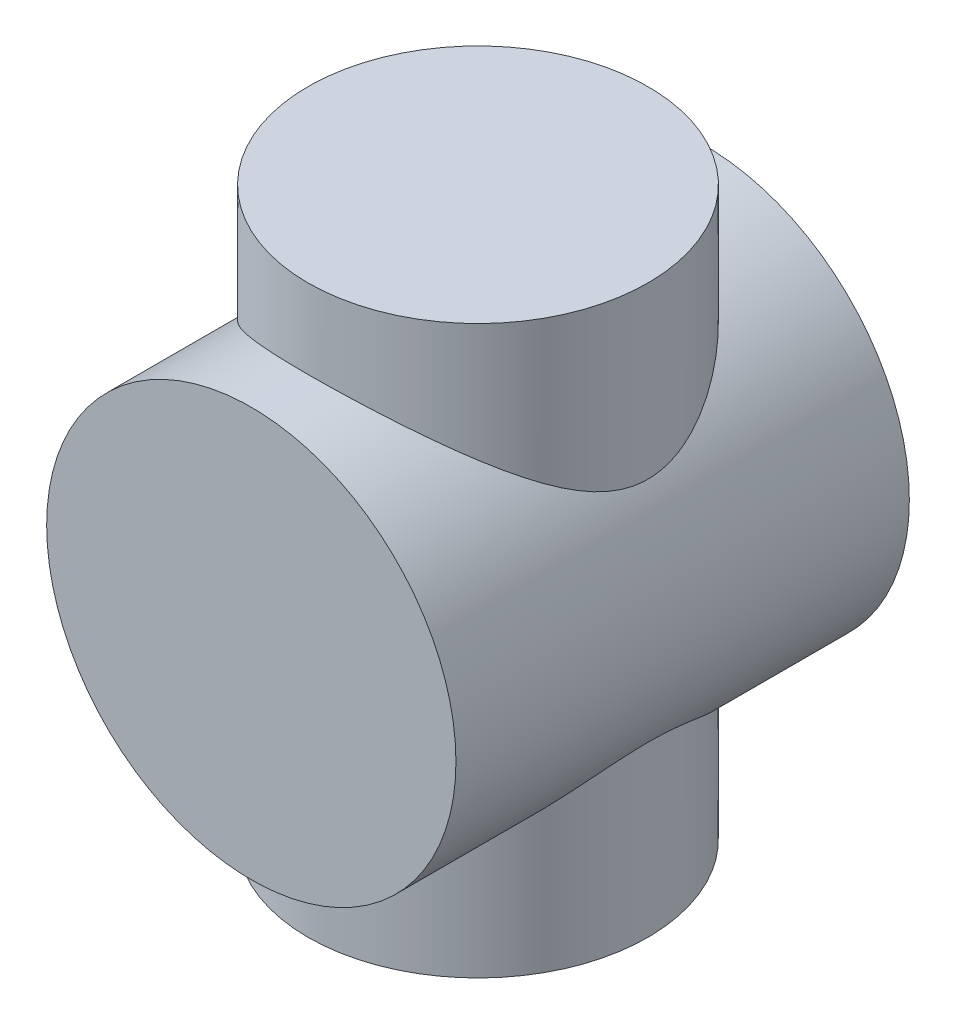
ISO-10303-21;
HEADER;
FILE_DESCRIPTION(('STEP AP214'),'2;1');
FILE_NAME('part.step','',(''),(''),'','','');
FILE_SCHEMA(('AUTOMOTIVE_DESIGN { 1 0 10303 214 1 1 1 1 }'));
ENDSEC;
DATA;
#1=APPLICATION_CONTEXT('core data for automotive mechanical design processes');
#2=APPLICATION_PROTOCOL_DEFINITION('international standard','automotive_design',2000,#1);
#3=PRODUCT_CONTEXT('',#1,'mechanical');
#4=PRODUCT('Part','Part','',(#3));
#5=PRODUCT_RELATED_PRODUCT_CATEGORY('part','',(#4));
#6=PRODUCT_DEFINITION_FORMATION('','',#4);
#7=PRODUCT_DEFINITION_CONTEXT('part definition',#1,'design');
#8=PRODUCT_DEFINITION('design','',#6,#7);
#9=PRODUCT_DEFINITION_SHAPE('','',#8);
#10=(LENGTH_UNIT() NAMED_UNIT(*) SI_UNIT(.MILLI.,.METRE.));
#11=(NAMED_UNIT(*) PLANE_ANGLE_UNIT() SI_UNIT($,.RADIAN.));
#12=(NAMED_UNIT(*) SI_UNIT($,.STERADIAN.) SOLID_ANGLE_UNIT());
#13=UNCERTAINTY_MEASURE_WITH_UNIT(LENGTH_MEASURE(1.E-05),#10,'distance_accuracy_value','');
#14=(GEOMETRIC_REPRESENTATION_CONTEXT(3) GLOBAL_UNCERTAINTY_ASSIGNED_CONTEXT((#13)) GLOBAL_UNIT_ASSIGNED_CONTEXT((#10,
#11,#12)) REPRESENTATION_CONTEXT('',''));
#15=CARTESIAN_POINT('',(0.,0.,0.));
#16=DIRECTION('',(0.,0.,1.));
#17=DIRECTION('',(1.,0.,0.));
#18=AXIS2_PLACEMENT_3D('',#15,#16,#17);
#19=CARTESIAN_POINT('',(0.,83.2970588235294,0.));
#20=DIRECTION('',(0.,1.,0.));
#21=DIRECTION('',(0.,0.,1.));
#22=AXIS2_PLACEMENT_3D('',#19,#20,#21);
#23=CYLINDRICAL_SURFACE('',#22,15.);
#24=CARTESIAN_POINT('',(0.,-1.81470588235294,0.));
#25=DIRECTION('',(0.,1.,0.));
#26=DIRECTION('',(0.,0.,1.));
#27=AXIS2_PLACEMENT_3D('',#24,#25,#26);
#28=CIRCLE('',#27,15.);
#29=CARTESIAN_POINT('',(0.,-1.81470588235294,15.));
#30=VERTEX_POINT('',#29);
#31=EDGE_CURVE('E40',#30,#30,#28,.T.);
#32=ORIENTED_EDGE('',*,*,#31,.T.);
#33=EDGE_LOOP('',(#32));
#34=FACE_BOUND('',#33,.T.);
#35=CARTESIAN_POINT('',(0.,5.08350239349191,15.));
#36=CARTESIAN_POINT('',(-0.35656720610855,5.08350518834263,14.9999971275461));
#37=CARTESIAN_POINT('',(-0.713181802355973,5.0940894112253,14.9872627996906));
#38=CARTESIAN_POINT('',(-1.42339529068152,5.13618434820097,14.9365577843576));
#39=CARTESIAN_POINT('',(-1.77699363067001,5.16769881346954,14.8985825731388));
#40=CARTESIAN_POINT('',(-2.47852909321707,5.25095476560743,14.7980590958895));
#41=CARTESIAN_POINT('',(-2.82646167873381,5.30271170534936,14.7354920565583));
#42=CARTESIAN_POINT('',(-3.51380237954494,5.42530843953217,14.5868723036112));
#43=CARTESIAN_POINT('',(-3.85321068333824,5.49614781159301,14.5008201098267));
#44=CARTESIAN_POINT('',(-4.51930477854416,5.65496762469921,14.3071820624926));
#45=CARTESIAN_POINT('',(-4.84605575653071,5.74284043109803,14.1997313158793));
#46=CARTESIAN_POINT('',(-5.48731963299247,5.93436954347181,13.9644543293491));
#47=CARTESIAN_POINT('',(-5.80183272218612,6.03802560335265,13.8366284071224));
#48=CARTESIAN_POINT('',(-6.41737648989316,6.25939366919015,13.5621110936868));
#49=CARTESIAN_POINT('',(-6.71840643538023,6.37710643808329,13.4154186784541));
#50=CARTESIAN_POINT('',(-7.30610883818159,6.62482198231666,13.1046298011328));
#51=CARTESIAN_POINT('',(-7.59277823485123,6.75482736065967,12.9405296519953));
#52=CARTESIAN_POINT('',(-8.25335666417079,7.07489081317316,12.5332689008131));
#53=CARTESIAN_POINT('',(-8.62079175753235,7.26951244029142,12.2831552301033));
#54=CARTESIAN_POINT('',(-9.3268787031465,7.67397956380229,11.756002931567));
#55=CARTESIAN_POINT('',(-9.66552077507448,7.88383018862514,11.4789552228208));
#56=CARTESIAN_POINT('',(-10.3144638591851,8.31491412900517,10.8996107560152));
#57=CARTESIAN_POINT('',(-10.6246910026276,8.53617489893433,10.5972518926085));
#58=CARTESIAN_POINT('',(-11.2157383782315,8.98512643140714,9.96960602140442));
#59=CARTESIAN_POINT('',(-11.4965622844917,9.21281638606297,9.64432188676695));
#60=CARTESIAN_POINT('',(-12.0336648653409,9.6741105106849,8.96558065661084));
#61=CARTESIAN_POINT('',(-12.2894039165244,9.90774690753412,8.611718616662));
#62=CARTESIAN_POINT('',(-12.7702248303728,10.3712604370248,7.88115884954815));
#63=CARTESIAN_POINT('',(-12.9952964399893,10.6011362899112,7.50445354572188));
#64=CARTESIAN_POINT('',(-13.4133815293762,11.049548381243,6.72866728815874));
#65=CARTESIAN_POINT('',(-13.6064714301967,11.2681107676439,6.3296428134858));
#66=CARTESIAN_POINT('',(-13.95951995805,11.6854416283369,5.50742266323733));
#67=CARTESIAN_POINT('',(-14.1195068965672,11.8842269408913,5.08424804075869));
#68=CARTESIAN_POINT('',(-14.3394738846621,12.1675926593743,4.40939149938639));
#69=CARTESIAN_POINT('',(-14.4120217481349,12.2632554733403,4.16641103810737));
#70=CARTESIAN_POINT('',(-14.545626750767,12.442633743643,3.67288697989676));
#71=CARTESIAN_POINT('',(-14.6066824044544,12.5263476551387,3.42234241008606));
#72=CARTESIAN_POINT('',(-14.7163881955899,12.6790308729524,2.91465458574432));
#73=CARTESIAN_POINT('',(-14.7650625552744,12.7480289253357,2.65752531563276));
#74=CARTESIAN_POINT('',(-14.8492977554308,12.8687851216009,2.13722842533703));
#75=CARTESIAN_POINT('',(-14.8848654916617,12.9205523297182,1.87406405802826));
#76=CARTESIAN_POINT('',(-14.9424928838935,13.0050164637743,1.33976584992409));
#77=CARTESIAN_POINT('',(-14.9643781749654,13.0374669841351,1.06857351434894));
#78=CARTESIAN_POINT('',(-14.9933381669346,13.0805073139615,0.523667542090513));
#79=CARTESIAN_POINT('',(-15.0004141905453,13.091099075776,0.249954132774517));
#80=CARTESIAN_POINT('',(-14.9995482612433,13.0898062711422,-0.297418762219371));
#81=CARTESIAN_POINT('',(-14.9916051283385,13.0779199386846,-0.571078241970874));
#82=CARTESIAN_POINT('',(-14.9609351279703,13.0323634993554,-1.1157330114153));
#83=CARTESIAN_POINT('',(-14.9382064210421,12.9986906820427,-1.38672796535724));
#84=CARTESIAN_POINT('',(-14.8758973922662,12.907462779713,-1.94790810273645));
#85=CARTESIAN_POINT('',(-14.8349909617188,12.84804002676,-2.23764018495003));
#86=CARTESIAN_POINT('',(-14.7374274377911,12.7087767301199,-2.80934604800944));
#87=CARTESIAN_POINT('',(-14.6807677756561,12.6289328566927,-3.09131855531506));
#88=CARTESIAN_POINT('',(-14.4885011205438,12.3637508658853,-3.92549255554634));
#89=CARTESIAN_POINT('',(-14.3307593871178,12.1530033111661,-4.46464766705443));
#90=CARTESIAN_POINT('',(-14.0023635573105,11.7387306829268,-5.3967487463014));
#91=CARTESIAN_POINT('',(-13.8412510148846,11.5428531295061,-5.79674908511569));
#92=CARTESIAN_POINT('',(-13.488968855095,11.1348340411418,-6.57495579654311));
#93=CARTESIAN_POINT('',(-13.2977818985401,10.9226831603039,-6.95314942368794));
#94=CARTESIAN_POINT('',(-12.886450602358,10.4894650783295,-7.68877561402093));
#95=CARTESIAN_POINT('',(-12.6662677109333,10.2683862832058,-8.04617960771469));
#96=CARTESIAN_POINT('',(-12.1977797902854,9.823490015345,-8.74009877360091));
#97=CARTESIAN_POINT('',(-11.9494803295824,9.5996730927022,-9.07661806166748));
#98=CARTESIAN_POINT('',(-11.4118099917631,9.14300655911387,-9.7449268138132));
#99=CARTESIAN_POINT('',(-11.121006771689,8.91026446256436,-10.0756396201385));
#100=CARTESIAN_POINT('',(-10.508559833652,8.45208157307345,-10.7128631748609));
#101=CARTESIAN_POINT('',(-10.1869115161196,8.22664187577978,-11.0193703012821));
#102=CARTESIAN_POINT('',(-9.51353821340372,7.78826201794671,-11.6056663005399));
#103=CARTESIAN_POINT('',(-9.16187225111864,7.57529865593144,-11.8855054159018));
#104=CARTESIAN_POINT('',(-8.42838703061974,7.1661436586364,-12.416403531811));
#105=CARTESIAN_POINT('',(-8.04657839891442,6.96994616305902,-12.6674725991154));
#106=CARTESIAN_POINT('',(-7.35287495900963,6.64540885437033,-13.0787905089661));
#107=CARTESIAN_POINT('',(-7.04732859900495,6.51235794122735,-13.2460629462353));
#108=CARTESIAN_POINT('',(-6.42066346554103,6.26043686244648,-13.5608986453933));
#109=CARTESIAN_POINT('',(-6.09954842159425,6.14156332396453,-13.7084665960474));
#110=CARTESIAN_POINT('',(-5.4429967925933,5.92006260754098,-13.9821392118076));
#111=CARTESIAN_POINT('',(-5.10756536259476,5.81742964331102,-14.1082515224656));
#112=CARTESIAN_POINT('',(-4.42391738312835,5.6303281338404,-14.3373252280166));
#113=CARTESIAN_POINT('',(-4.07570061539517,5.54585989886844,-14.4402862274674));
#114=CARTESIAN_POINT('',(-3.36599139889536,5.39632637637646,-14.6220816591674));
#115=CARTESIAN_POINT('',(-3.00441860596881,5.33141229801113,-14.7007281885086));
#116=CARTESIAN_POINT('',(-2.27325720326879,5.22338268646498,-14.8313922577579));
#117=CARTESIAN_POINT('',(-1.90366857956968,5.18026719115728,-14.8834097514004));
#118=CARTESIAN_POINT('',(-1.15986629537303,5.11693500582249,-14.9597595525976));
#119=CARTESIAN_POINT('',(-0.78565497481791,5.09670717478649,-14.9841053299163));
#120=CARTESIAN_POINT('',(-0.0359460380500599,5.07964631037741,-15.0046420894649));
#121=CARTESIAN_POINT('',(0.339551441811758,5.08281086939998,-15.0008359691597));
#122=CARTESIAN_POINT('',(1.04454850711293,5.11070566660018,-14.967249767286));
#123=CARTESIAN_POINT('',(1.37430371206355,5.13287690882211,-14.9405516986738));
#124=CARTESIAN_POINT('',(2.02965338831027,5.19493649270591,-14.8657073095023));
#125=CARTESIAN_POINT('',(2.35524824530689,5.23482317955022,-14.8175629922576));
#126=CARTESIAN_POINT('',(3.00013613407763,5.33153985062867,-14.7005646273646));
#127=CARTESIAN_POINT('',(3.31942877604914,5.38837087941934,-14.6317093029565));
#128=CARTESIAN_POINT('',(3.9498099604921,5.51793244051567,-14.4742723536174));
#129=CARTESIAN_POINT('',(4.26089808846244,5.5906637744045,-14.3856897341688));
#130=CARTESIAN_POINT('',(4.87867772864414,5.75219829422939,-14.1882177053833));
#131=CARTESIAN_POINT('',(5.18519490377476,5.84126233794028,-14.078997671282));
#132=CARTESIAN_POINT('',(5.78675207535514,6.033128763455,-13.8426136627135));
#133=CARTESIAN_POINT('',(6.08179228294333,6.13593089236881,-13.7154500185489));
#134=CARTESIAN_POINT('',(6.65946055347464,6.35378623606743,-13.4444556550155));
#135=CARTESIAN_POINT('',(6.94208689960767,6.46884113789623,-13.3006226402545));
#136=CARTESIAN_POINT('',(7.49421997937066,6.7096759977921,-12.9975340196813));
#137=CARTESIAN_POINT('',(7.76372406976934,6.83545810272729,-12.8382753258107));
#138=CARTESIAN_POINT('',(8.40756184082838,7.15502219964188,-12.4304631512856));
#139=CARTESIAN_POINT('',(8.77440066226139,7.35390252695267,-12.1740136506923));
#140=CARTESIAN_POINT('',(9.47869108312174,7.76653564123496,-11.6340656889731));
#141=CARTESIAN_POINT('',(9.81613125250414,7.98029415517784,-11.3505567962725));
#142=CARTESIAN_POINT('',(10.4622404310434,8.41882305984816,-10.7579855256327));
#143=CARTESIAN_POINT('',(10.7708208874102,8.64362431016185,-10.4488496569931));
#144=CARTESIAN_POINT('',(11.357984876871,9.09902099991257,-9.80740753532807));
#145=CARTESIAN_POINT('',(11.6365727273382,9.3296155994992,-9.4751046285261));
#146=CARTESIAN_POINT('',(12.1684343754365,9.79580759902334,-8.78199529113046));
#147=CARTESIAN_POINT('',(12.4211711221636,10.0314211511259,-8.42078764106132));
#148=CARTESIAN_POINT('',(12.8953210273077,10.4976745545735,-7.67502626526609));
#149=CARTESIAN_POINT('',(13.1167222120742,10.728312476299,-7.29046369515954));
#150=CARTESIAN_POINT('',(13.5265257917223,11.1763726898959,-6.49856589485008));
#151=CARTESIAN_POINT('',(13.7150244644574,11.3938322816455,-6.09130186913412));
#152=CARTESIAN_POINT('',(14.0578150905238,11.8064429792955,-5.25195090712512));
#153=CARTESIAN_POINT('',(14.2121407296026,12.0016159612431,-4.81988894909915));
#154=CARTESIAN_POINT('',(14.4202882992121,12.2741341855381,-4.13727941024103));
#155=CARTESIAN_POINT('',(14.4874707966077,12.3640612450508,-3.89577377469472));
#156=CARTESIAN_POINT('',(14.6104762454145,12.5314807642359,-3.40556020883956));
#157=CARTESIAN_POINT('',(14.6662979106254,12.6089718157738,-3.15685146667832));
#158=CARTESIAN_POINT('',(14.765684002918,12.748817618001,-2.65334999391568));
#159=CARTESIAN_POINT('',(14.8092739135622,12.811203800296,-2.39857113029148));
#160=CARTESIAN_POINT('',(14.8835369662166,12.9185328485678,-1.88359912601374));
#161=CARTESIAN_POINT('',(14.9142167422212,12.9634846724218,-1.6234088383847));
#162=CARTESIAN_POINT('',(14.962256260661,13.0342634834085,-1.09621775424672));
#163=CARTESIAN_POINT('',(14.9794647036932,13.0598731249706,-0.829173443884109));
#164=CARTESIAN_POINT('',(14.9995267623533,13.0897575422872,-0.29335525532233));
#165=CARTESIAN_POINT('',(15.0023813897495,13.0940338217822,-0.0245815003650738));
#166=CARTESIAN_POINT('',(14.9936533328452,13.0810086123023,0.512332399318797));
#167=CARTESIAN_POINT('',(14.9820635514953,13.0636965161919,0.780472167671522));
#168=CARTESIAN_POINT('',(14.9447604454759,13.0084396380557,1.31361605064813));
#169=CARTESIAN_POINT('',(14.919045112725,12.9704919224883,1.5786197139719));
#170=CARTESIAN_POINT('',(14.8496938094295,12.8694159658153,2.13937497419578));
#171=CARTESIAN_POINT('',(14.8040912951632,12.803558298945,2.43438791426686));
#172=CARTESIAN_POINT('',(14.696644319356,12.6513131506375,3.01598805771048));
#173=CARTESIAN_POINT('',(14.6347964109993,12.5649213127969,3.30257345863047));
#174=CARTESIAN_POINT('',(14.4958717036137,12.375227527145,3.86709709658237));
#175=CARTESIAN_POINT('',(14.418755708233,12.2718821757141,4.14501090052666));
#176=CARTESIAN_POINT('',(14.2504090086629,12.0520052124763,4.69122101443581));
#177=CARTESIAN_POINT('',(14.1591728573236,11.935468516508,4.95951356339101));
#178=CARTESIAN_POINT('',(13.906300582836,11.6214658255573,5.64030657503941));
#179=CARTESIAN_POINT('',(13.7346456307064,11.4164492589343,6.04562408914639));
#180=CARTESIAN_POINT('',(13.3602074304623,10.9913491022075,6.83338742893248));
#181=CARTESIAN_POINT('',(13.1574066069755,10.771257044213,7.21582017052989));
#182=CARTESIAN_POINT('',(12.7215850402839,10.3233228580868,7.95908646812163));
#183=CARTESIAN_POINT('',(12.4885248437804,10.0954709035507,8.3198909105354));
#184=CARTESIAN_POINT('',(11.9929648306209,9.63835604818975,9.01956304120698));
#185=CARTESIAN_POINT('',(11.7304708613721,9.40909343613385,9.35843506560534));
#186=CARTESIAN_POINT('',(11.1640945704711,8.94427014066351,10.0281381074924));
#187=CARTESIAN_POINT('',(10.8589099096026,8.70886832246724,10.3579808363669));
#188=CARTESIAN_POINT('',(10.2165517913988,8.24710961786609,10.9920756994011));
#189=CARTESIAN_POINT('',(9.87937308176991,8.02075422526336,11.2963236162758));
#190=CARTESIAN_POINT('',(9.17394368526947,7.58255375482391,11.876313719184));
#191=CARTESIAN_POINT('',(8.80575764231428,7.37068007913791,12.1521126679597));
#192=CARTESIAN_POINT('',(8.03839616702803,6.96598257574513,12.6727636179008));
#193=CARTESIAN_POINT('',(7.63923421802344,6.77315054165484,12.917628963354));
#194=CARTESIAN_POINT('',(6.92603394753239,6.46168260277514,13.3096477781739));
#195=CARTESIAN_POINT('',(6.61903260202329,6.33728752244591,13.4650822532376));
#196=CARTESIAN_POINT('',(5.99049700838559,6.10304567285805,13.756228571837));
#197=CARTESIAN_POINT('',(5.66896627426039,5.99319541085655,13.8919451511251));
#198=CARTESIAN_POINT('',(5.01304100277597,5.79006166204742,14.1418687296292));
#199=CARTESIAN_POINT('',(4.67866252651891,5.69675826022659,14.2561015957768));
#200=CARTESIAN_POINT('',(3.99846111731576,5.52836692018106,14.4616198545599));
#201=CARTESIAN_POINT('',(3.65264034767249,5.45327556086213,14.5529095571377));
#202=CARTESIAN_POINT('',(3.0345077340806,5.33826720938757,14.692418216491));
#203=CARTESIAN_POINT('',(2.76409359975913,5.2942313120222,14.7457173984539));
#204=CARTESIAN_POINT('',(2.21901128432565,5.21827969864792,14.8375323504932));
#205=CARTESIAN_POINT('',(1.94434234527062,5.1863661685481,14.8760454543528));
#206=CARTESIAN_POINT('',(1.3920932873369,5.13511728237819,14.9378472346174));
#207=CARTESIAN_POINT('',(1.11451283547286,5.1157833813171,14.9611341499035));
#208=CARTESIAN_POINT('',(0.557964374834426,5.08997629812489,14.9922099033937));
#209=CARTESIAN_POINT('',(0.278996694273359,5.0835002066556,15.000002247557));
#210=CARTESIAN_POINT('',(0.,5.08350239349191,15.));
#211=B_SPLINE_CURVE_WITH_KNOTS('',3,(#35,#36,#37,#38,#39,#40,#41,#42,#43,#44,#45,#46,#47,#48,
#49,#50,#51,#52,#53,#54,#55,#56,#57,#58,#59,#60,#61,#62,#63,#64,#65,#66,#67,#68,#69,#70,#71,#72,
#73,#74,#75,#76,#77,#78,#79,#80,#81,#82,#83,#84,#85,#86,#87,#88,#89,#90,#91,#92,#93,#94,#95,#96,
#97,#98,#99,#100,#101,#102,#103,#104,#105,#106,#107,#108,#109,#110,#111,#112,#113,#114,#115,
#116,#117,#118,#119,#120,#121,#122,#123,#124,#125,#126,#127,#128,#129,#130,#131,#132,#133,#134,
#135,#136,#137,#138,#139,#140,#141,#142,#143,#144,#145,#146,#147,#148,#149,#150,#151,#152,#153,
#154,#155,#156,#157,#158,#159,#160,#161,#162,#163,#164,#165,#166,#167,#168,#169,#170,#171,#172,
#173,#174,#175,#176,#177,#178,#179,#180,#181,#182,#183,#184,#185,#186,#187,#188,#189,#190,#191,
#192,#193,#194,#195,#196,#197,#198,#199,#200,#201,#202,#203,#204,#205,#206,#207,#208,#209,#210),
.UNSPECIFIED.,.T.,.F.,(4,2,2,2,2,2,2,2,2,2,2,2,2,2,2,2,2,2,2,2,2,2,2,2,2,2,2,2,2,2,2,2,2,2,2,2,
2,2,2,2,2,2,2,2,2,2,2,2,2,2,2,2,2,2,2,2,2,2,2,2,2,2,2,2,2,2,2,2,2,2,2,2,2,2,2,2,2,2,2,2,2,2,2,2,
2,2,2,4),(0.,1.06940342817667,2.13899856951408,3.20941182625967,4.2798013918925,
5.34363553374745,6.40745308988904,7.47132841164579,8.53542951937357,9.98901385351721,
11.4430899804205,12.9008448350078,14.3584173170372,15.8425125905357,17.327102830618,
18.8080927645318,20.2878107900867,21.1003835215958,21.9130612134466,22.7241365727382,
23.5347845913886,24.3555632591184,25.1762686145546,25.9970384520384,26.8179104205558,
27.7122473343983,28.6067301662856,30.39964680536,31.8189240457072,33.2390225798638,
34.6610286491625,36.0827535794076,37.5755228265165,39.0685150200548,40.5586363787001,
42.0482347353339,43.1658788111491,44.2832564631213,45.4002351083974,46.5172328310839,
47.6426585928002,48.7680863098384,49.8929659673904,51.0177298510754,52.0112749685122,
53.0047272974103,53.9982408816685,54.9918045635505,56.0028933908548,57.0139636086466,
58.0251732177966,59.0365856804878,60.5038201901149,61.971622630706,63.4437904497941,
64.9157460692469,66.4138269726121,67.9124787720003,69.4066689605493,70.8993796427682,
71.697820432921,72.4963515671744,73.2932064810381,74.0896514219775,74.8949179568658,
75.7001277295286,76.5057332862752,77.3114533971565,78.2271181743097,79.1429773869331,
80.0612190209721,80.9798157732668,82.4343163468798,83.8896407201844,85.3468820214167,
86.8038343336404,88.3240581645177,89.8445319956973,91.3619109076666,92.8786329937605,
93.9753466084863,95.0717963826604,96.1669174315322,97.2618326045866,98.0985311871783,
98.9353805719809,99.7723267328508,100.609083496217),.UNSPECIFIED.);
#212=CARTESIAN_POINT('',(0.,5.08350239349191,15.));
#213=VERTEX_POINT('',#212);
#214=EDGE_CURVE('E33',#213,#213,#211,.T.);
#215=ORIENTED_EDGE('',*,*,#214,.T.);
#216=EDGE_LOOP('',(#215));
#217=FACE_BOUND('',#216,.T.);
#218=ADVANCED_FACE('F29',(#34,#217),#23,.T.);
#219=CARTESIAN_POINT('',(-15.,-1.81470588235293,0.));
#220=DIRECTION('',(0.,-1.,0.));
#221=DIRECTION('',(0.,0.,-1.));
#222=AXIS2_PLACEMENT_3D('',#219,#220,#221);
#223=PLANE('',#222);
#224=ORIENTED_EDGE('',*,*,#31,.F.);
#225=EDGE_LOOP('',(#224));
#226=FACE_BOUND('',#225,.T.);
#227=ADVANCED_FACE('F59',(#226),#223,.T.);
#228=CARTESIAN_POINT('',(0.,23.1372356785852,20.));
#229=DIRECTION('',(0.,0.,-1.));
#230=DIRECTION('',(-1.,0.,0.));
#231=AXIS2_PLACEMENT_3D('',#228,#229,#230);
#232=CYLINDRICAL_SURFACE('',#231,18.0537332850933);
#233=ORIENTED_EDGE('',*,*,#214,.F.);
#234=EDGE_LOOP('',(#233));
#235=FACE_BOUND('',#234,.T.);
#236=CARTESIAN_POINT('',(0.,41.1909689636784,15.));
#237=CARTESIAN_POINT('',(0.356567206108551,41.1909661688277,14.9999971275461));
#238=CARTESIAN_POINT('',(0.713181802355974,41.180381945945,14.9872627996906));
#239=CARTESIAN_POINT('',(1.42339529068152,41.1382870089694,14.9365577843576));
#240=CARTESIAN_POINT('',(1.77699363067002,41.1067725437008,14.8985825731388));
#241=CARTESIAN_POINT('',(2.47852909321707,41.0235165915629,14.7980590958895));
#242=CARTESIAN_POINT('',(2.82646167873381,40.971759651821,14.7354920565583));
#243=CARTESIAN_POINT('',(3.51380237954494,40.8491629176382,14.5868723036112));
#244=CARTESIAN_POINT('',(3.85321068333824,40.7783235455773,14.5008201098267));
#245=CARTESIAN_POINT('',(4.51930477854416,40.6195037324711,14.3071820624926));
#246=CARTESIAN_POINT('',(4.84605575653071,40.5316309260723,14.1997313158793));
#247=CARTESIAN_POINT('',(5.48731963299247,40.3401018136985,13.9644543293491));
#248=CARTESIAN_POINT('',(5.80183272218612,40.2364457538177,13.8366284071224));
#249=CARTESIAN_POINT('',(6.41737648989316,40.0150776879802,13.5621110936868));
#250=CARTESIAN_POINT('',(6.71840643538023,39.8973649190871,13.4154186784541));
#251=CARTESIAN_POINT('',(7.30610883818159,39.6496493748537,13.1046298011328));
#252=CARTESIAN_POINT('',(7.59277823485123,39.5196439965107,12.9405296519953));
#253=CARTESIAN_POINT('',(8.2533566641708,39.1995805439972,12.5332689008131));
#254=CARTESIAN_POINT('',(8.62079175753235,39.0049589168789,12.2831552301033));
#255=CARTESIAN_POINT('',(9.32687870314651,38.600491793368,11.756002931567));
#256=CARTESIAN_POINT('',(9.66552077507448,38.3906411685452,11.4789552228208));
#257=CARTESIAN_POINT('',(10.3144638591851,37.9595572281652,10.8996107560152));
#258=CARTESIAN_POINT('',(10.6246910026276,37.738296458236,10.5972518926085));
#259=CARTESIAN_POINT('',(11.2157383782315,37.2893449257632,9.96960602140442));
#260=CARTESIAN_POINT('',(11.4965622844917,37.0616549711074,9.64432188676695));
#261=CARTESIAN_POINT('',(12.0336648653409,36.6003608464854,8.96558065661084));
#262=CARTESIAN_POINT('',(12.2894039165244,36.3667244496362,8.611718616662));
#263=CARTESIAN_POINT('',(12.7702248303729,35.9032109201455,7.88115884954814));
#264=CARTESIAN_POINT('',(12.9952964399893,35.6733350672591,7.50445354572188));
#265=CARTESIAN_POINT('',(13.4133815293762,35.2249229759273,6.72866728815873));
#266=CARTESIAN_POINT('',(13.6064714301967,35.0063605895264,6.3296428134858));
#267=CARTESIAN_POINT('',(13.95951995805,34.5890297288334,5.50742266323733));
#268=CARTESIAN_POINT('',(14.1195068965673,34.3902444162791,5.08424804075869));
#269=CARTESIAN_POINT('',(14.3394738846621,34.106878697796,4.40939149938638));
#270=CARTESIAN_POINT('',(14.4120217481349,34.01121588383,4.16641103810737));
#271=CARTESIAN_POINT('',(14.545626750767,33.8318376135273,3.67288697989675));
#272=CARTESIAN_POINT('',(14.6066824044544,33.7481237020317,3.42234241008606));
#273=CARTESIAN_POINT('',(14.7163881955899,33.5954404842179,2.91465458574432));
#274=CARTESIAN_POINT('',(14.7650625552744,33.5264424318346,2.65752531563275));
#275=CARTESIAN_POINT('',(14.8492977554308,33.4056862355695,2.13722842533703));
#276=CARTESIAN_POINT('',(14.8848654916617,33.3539190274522,1.87406405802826));
#277=CARTESIAN_POINT('',(14.9424928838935,33.269454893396,1.33976584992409));
#278=CARTESIAN_POINT('',(14.9643781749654,33.2370043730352,1.06857351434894));
#279=CARTESIAN_POINT('',(14.9933381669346,33.1939640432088,0.523667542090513));
#280=CARTESIAN_POINT('',(15.0004141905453,33.1833722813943,0.249954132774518));
#281=CARTESIAN_POINT('',(14.9995482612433,33.1846650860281,-0.29741876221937));
#282=CARTESIAN_POINT('',(14.9916051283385,33.1965514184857,-0.571078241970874));
#283=CARTESIAN_POINT('',(14.9609351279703,33.242107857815,-1.1157330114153));
#284=CARTESIAN_POINT('',(14.9382064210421,33.2757806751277,-1.38672796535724));
#285=CARTESIAN_POINT('',(14.8758973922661,33.3670085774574,-1.94790810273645));
#286=CARTESIAN_POINT('',(14.8349909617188,33.4264313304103,-2.23764018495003));
#287=CARTESIAN_POINT('',(14.7374274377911,33.5656946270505,-2.80934604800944));
#288=CARTESIAN_POINT('',(14.6807677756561,33.6455385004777,-3.09131855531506));
#289=CARTESIAN_POINT('',(14.4885011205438,33.9107204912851,-3.92549255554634));
#290=CARTESIAN_POINT('',(14.3307593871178,34.1214680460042,-4.46464766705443));
#291=CARTESIAN_POINT('',(14.0023635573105,34.5357406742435,-5.3967487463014));
#292=CARTESIAN_POINT('',(13.8412510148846,34.7316182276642,-5.7967490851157));
#293=CARTESIAN_POINT('',(13.488968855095,35.1396373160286,-6.57495579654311));
#294=CARTESIAN_POINT('',(13.2977818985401,35.3517881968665,-6.95314942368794));
#295=CARTESIAN_POINT('',(12.886450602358,35.7850062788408,-7.68877561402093));
#296=CARTESIAN_POINT('',(12.6662677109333,36.0060850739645,-8.04617960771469));
#297=CARTESIAN_POINT('',(12.1977797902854,36.4509813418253,-8.74009877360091));
#298=CARTESIAN_POINT('',(11.9494803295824,36.6747982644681,-9.07661806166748));
#299=CARTESIAN_POINT('',(11.4118099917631,37.1314647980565,-9.7449268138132));
#300=CARTESIAN_POINT('',(11.121006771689,37.364206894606,-10.0756396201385));
#301=CARTESIAN_POINT('',(10.508559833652,37.8223897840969,-10.7128631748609));
#302=CARTESIAN_POINT('',(10.1869115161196,38.0478294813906,-11.0193703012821));
#303=CARTESIAN_POINT('',(9.51353821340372,38.4862093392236,-11.6056663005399));
#304=CARTESIAN_POINT('',(9.16187225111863,38.6991727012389,-11.8855054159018));
#305=CARTESIAN_POINT('',(8.42838703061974,39.1083276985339,-12.416403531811));
#306=CARTESIAN_POINT('',(8.04657839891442,39.3045251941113,-12.6674725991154));
#307=CARTESIAN_POINT('',(7.35287495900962,39.6290625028,-13.0787905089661));
#308=CARTESIAN_POINT('',(7.04732859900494,39.762113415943,-13.2460629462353));
#309=CARTESIAN_POINT('',(6.42066346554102,40.0140344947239,-13.5608986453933));
#310=CARTESIAN_POINT('',(6.09954842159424,40.1329080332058,-13.7084665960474));
#311=CARTESIAN_POINT('',(5.44299679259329,40.3544087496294,-13.9821392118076));
#312=CARTESIAN_POINT('',(5.10756536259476,40.4570417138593,-14.1082515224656));
#313=CARTESIAN_POINT('',(4.42391738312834,40.6441432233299,-14.3373252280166));
#314=CARTESIAN_POINT('',(4.07570061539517,40.7286114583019,-14.4402862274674));
#315=CARTESIAN_POINT('',(3.36599139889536,40.8781449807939,-14.6220816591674));
#316=CARTESIAN_POINT('',(3.00441860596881,40.9430590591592,-14.7007281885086));
#317=CARTESIAN_POINT('',(2.27325720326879,41.0510886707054,-14.8313922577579));
#318=CARTESIAN_POINT('',(1.90366857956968,41.0942041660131,-14.8834097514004));
#319=CARTESIAN_POINT('',(1.15986629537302,41.1575363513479,-14.9597595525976));
#320=CARTESIAN_POINT('',(0.785654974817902,41.1777641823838,-14.9841053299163));
#321=CARTESIAN_POINT('',(0.035946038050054,41.1948250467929,-15.0046420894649));
#322=CARTESIAN_POINT('',(-0.339551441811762,41.1916604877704,-15.0008359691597));
#323=CARTESIAN_POINT('',(-1.04454850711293,41.1637656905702,-14.967249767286));
#324=CARTESIAN_POINT('',(-1.37430371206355,41.1415944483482,-14.9405516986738));
#325=CARTESIAN_POINT('',(-2.02965338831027,41.0795348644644,-14.8657073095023));
#326=CARTESIAN_POINT('',(-2.35524824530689,41.0396481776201,-14.8175629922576));
#327=CARTESIAN_POINT('',(-3.00013613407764,40.9429315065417,-14.7005646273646));
#328=CARTESIAN_POINT('',(-3.31942877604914,40.886100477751,-14.6317093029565));
#329=CARTESIAN_POINT('',(-3.9498099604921,40.7565389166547,-14.4742723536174));
#330=CARTESIAN_POINT('',(-4.26089808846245,40.6838075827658,-14.3856897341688));
#331=CARTESIAN_POINT('',(-4.87867772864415,40.522273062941,-14.1882177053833));
#332=CARTESIAN_POINT('',(-5.18519490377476,40.4332090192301,-14.078997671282));
#333=CARTESIAN_POINT('',(-5.78675207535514,40.2413425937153,-13.8426136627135));
#334=CARTESIAN_POINT('',(-6.08179228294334,40.1385404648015,-13.7154500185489));
#335=CARTESIAN_POINT('',(-6.65946055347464,39.9206851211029,-13.4444556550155));
#336=CARTESIAN_POINT('',(-6.94208689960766,39.8056302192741,-13.3006226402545));
#337=CARTESIAN_POINT('',(-7.49421997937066,39.5647953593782,-12.9975340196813));
#338=CARTESIAN_POINT('',(-7.76372406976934,39.439013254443,-12.8382753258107));
#339=CARTESIAN_POINT('',(-8.40756184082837,39.1194491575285,-12.4304631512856));
#340=CARTESIAN_POINT('',(-8.77440066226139,38.9205688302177,-12.1740136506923));
#341=CARTESIAN_POINT('',(-9.47869108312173,38.5079357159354,-11.6340656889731));
#342=CARTESIAN_POINT('',(-9.81613125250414,38.2941772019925,-11.3505567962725));
#343=CARTESIAN_POINT('',(-10.4622404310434,37.8556482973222,-10.7579855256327));
#344=CARTESIAN_POINT('',(-10.7708208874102,37.6308470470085,-10.4488496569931));
#345=CARTESIAN_POINT('',(-11.357984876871,37.1754503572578,-9.80740753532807));
#346=CARTESIAN_POINT('',(-11.6365727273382,36.9448557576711,-9.47510462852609));
#347=CARTESIAN_POINT('',(-12.1684343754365,36.478663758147,-8.78199529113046));
#348=CARTESIAN_POINT('',(-12.4211711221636,36.2430502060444,-8.42078764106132));
#349=CARTESIAN_POINT('',(-12.8953210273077,35.7767968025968,-7.67502626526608));
#350=CARTESIAN_POINT('',(-13.1167222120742,35.5461588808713,-7.29046369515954));
#351=CARTESIAN_POINT('',(-13.5265257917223,35.0980986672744,-6.49856589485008));
#352=CARTESIAN_POINT('',(-13.7150244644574,34.8806390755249,-6.09130186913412));
#353=CARTESIAN_POINT('',(-14.0578150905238,34.4680283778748,-5.25195090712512));
#354=CARTESIAN_POINT('',(-14.2121407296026,34.2728553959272,-4.81988894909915));
#355=CARTESIAN_POINT('',(-14.4202882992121,34.0003371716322,-4.13727941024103));
#356=CARTESIAN_POINT('',(-14.4874707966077,33.9104101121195,-3.89577377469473));
#357=CARTESIAN_POINT('',(-14.6104762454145,33.7429905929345,-3.40556020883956));
#358=CARTESIAN_POINT('',(-14.6662979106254,33.6654995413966,-3.15685146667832));
#359=CARTESIAN_POINT('',(-14.765684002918,33.5256537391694,-2.65334999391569));
#360=CARTESIAN_POINT('',(-14.8092739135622,33.4632675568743,-2.39857113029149));
#361=CARTESIAN_POINT('',(-14.8835369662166,33.3559385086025,-1.88359912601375));
#362=CARTESIAN_POINT('',(-14.9142167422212,33.3109866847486,-1.62340883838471));
#363=CARTESIAN_POINT('',(-14.962256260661,33.2402078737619,-1.09621775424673));
#364=CARTESIAN_POINT('',(-14.9794647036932,33.2145982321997,-0.829173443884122));
#365=CARTESIAN_POINT('',(-14.9995267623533,33.1847138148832,-0.293355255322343));
#366=CARTESIAN_POINT('',(-15.0023813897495,33.1804375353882,-0.0245815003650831));
#367=CARTESIAN_POINT('',(-14.9936533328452,33.193462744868,0.512332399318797));
#368=CARTESIAN_POINT('',(-14.9820635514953,33.2107748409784,0.780472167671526));
#369=CARTESIAN_POINT('',(-14.9447604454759,33.2660317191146,1.31361605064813));
#370=CARTESIAN_POINT('',(-14.919045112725,33.303979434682,1.5786197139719));
#371=CARTESIAN_POINT('',(-14.8496938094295,33.405055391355,2.13937497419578));
#372=CARTESIAN_POINT('',(-14.8040912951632,33.4709130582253,2.43438791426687));
#373=CARTESIAN_POINT('',(-14.696644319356,33.6231582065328,3.01598805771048));
#374=CARTESIAN_POINT('',(-14.6347964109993,33.7095500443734,3.30257345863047));
#375=CARTESIAN_POINT('',(-14.4958717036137,33.8992438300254,3.86709709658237));
#376=CARTESIAN_POINT('',(-14.418755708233,34.0025891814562,4.14501090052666));
#377=CARTESIAN_POINT('',(-14.2504090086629,34.222466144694,4.69122101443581));
#378=CARTESIAN_POINT('',(-14.1591728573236,34.3390028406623,4.959513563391));
#379=CARTESIAN_POINT('',(-13.906300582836,34.6530055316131,5.6403065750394));
#380=CARTESIAN_POINT('',(-13.7346456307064,34.858022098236,6.04562408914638));
#381=CARTESIAN_POINT('',(-13.3602074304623,35.2831222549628,6.83338742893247));
#382=CARTESIAN_POINT('',(-13.1574066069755,35.5032143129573,7.21582017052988));
#383=CARTESIAN_POINT('',(-12.7215850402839,35.9511484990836,7.95908646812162));
#384=CARTESIAN_POINT('',(-12.4885248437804,36.1790004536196,8.31989091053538));
#385=CARTESIAN_POINT('',(-11.9929648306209,36.6361153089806,9.01956304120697));
#386=CARTESIAN_POINT('',(-11.7304708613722,36.8653779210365,9.35843506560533));
#387=CARTESIAN_POINT('',(-11.1640945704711,37.3302012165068,10.0281381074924));
#388=CARTESIAN_POINT('',(-10.8589099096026,37.5656030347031,10.3579808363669));
#389=CARTESIAN_POINT('',(-10.2165517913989,38.0273617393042,10.9920756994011));
#390=CARTESIAN_POINT('',(-9.87937308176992,38.253717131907,11.2963236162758));
#391=CARTESIAN_POINT('',(-9.17394368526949,38.6919176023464,11.876313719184));
#392=CARTESIAN_POINT('',(-8.80575764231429,38.9037912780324,12.1521126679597));
#393=CARTESIAN_POINT('',(-8.03839616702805,39.3084887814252,12.6727636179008));
#394=CARTESIAN_POINT('',(-7.63923421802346,39.5013208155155,12.9176289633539));
#395=CARTESIAN_POINT('',(-6.92603394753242,39.8127887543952,13.3096477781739));
#396=CARTESIAN_POINT('',(-6.61903260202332,39.9371838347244,13.4650822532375));
#397=CARTESIAN_POINT('',(-5.99049700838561,40.1714256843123,13.756228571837));
#398=CARTESIAN_POINT('',(-5.66896627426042,40.2812759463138,13.8919451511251));
#399=CARTESIAN_POINT('',(-5.013041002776,40.4844096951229,14.1418687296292));
#400=CARTESIAN_POINT('',(-4.67866252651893,40.5777130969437,14.2561015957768));
#401=CARTESIAN_POINT('',(-3.99846111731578,40.7461044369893,14.4616198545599));
#402=CARTESIAN_POINT('',(-3.65264034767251,40.8211957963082,14.5529095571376));
#403=CARTESIAN_POINT('',(-3.03450773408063,40.9362041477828,14.692418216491));
#404=CARTESIAN_POINT('',(-2.76409359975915,40.9802400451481,14.7457173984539));
#405=CARTESIAN_POINT('',(-2.21901128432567,41.0561916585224,14.8375323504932));
#406=CARTESIAN_POINT('',(-1.94434234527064,41.0881051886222,14.8760454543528));
#407=CARTESIAN_POINT('',(-1.3920932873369,41.1393540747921,14.9378472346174));
#408=CARTESIAN_POINT('',(-1.11451283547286,41.1586879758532,14.9611341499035));
#409=CARTESIAN_POINT('',(-0.557964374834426,41.1844950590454,14.9922099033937));
#410=CARTESIAN_POINT('',(-0.278996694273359,41.1909711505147,15.000002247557));
#411=CARTESIAN_POINT('',(0.,41.1909689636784,15.));
#412=B_SPLINE_CURVE_WITH_KNOTS('',3,(#236,#237,#238,#239,#240,#241,#242,#243,#244,#245,#246,
#247,#248,#249,#250,#251,#252,#253,#254,#255,#256,#257,#258,#259,#260,#261,#262,#263,#264,#265,
#266,#267,#268,#269,#270,#271,#272,#273,#274,#275,#276,#277,#278,#279,#280,#281,#282,#283,#284,
#285,#286,#287,#288,#289,#290,#291,#292,#293,#294,#295,#296,#297,#298,#299,#300,#301,#302,#303,
#304,#305,#306,#307,#308,#309,#310,#311,#312,#313,#314,#315,#316,#317,#318,#319,#320,#321,#322,
#323,#324,#325,#326,#327,#328,#329,#330,#331,#332,#333,#334,#335,#336,#337,#338,#339,#340,#341,
#342,#343,#344,#345,#346,#347,#348,#349,#350,#351,#352,#353,#354,#355,#356,#357,#358,#359,#360,
#361,#362,#363,#364,#365,#366,#367,#368,#369,#370,#371,#372,#373,#374,#375,#376,#377,#378,#379,
#380,#381,#382,#383,#384,#385,#386,#387,#388,#389,#390,#391,#392,#393,#394,#395,#396,#397,#398,
#399,#400,#401,#402,#403,#404,#405,#406,#407,#408,#409,#410,#411),.UNSPECIFIED.,.T.,.F.,(4,2,2,
2,2,2,2,2,2,2,2,2,2,2,2,2,2,2,2,2,2,2,2,2,2,2,2,2,2,2,2,2,2,2,2,2,2,2,2,2,2,2,2,2,2,2,2,2,2,2,2,
2,2,2,2,2,2,2,2,2,2,2,2,2,2,2,2,2,2,2,2,2,2,2,2,2,2,2,2,2,2,2,2,2,2,2,2,4),(0.,1.06940342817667,
2.13899856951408,3.20941182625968,4.2798013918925,5.34363553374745,6.40745308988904,
7.47132841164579,8.53542951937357,9.98901385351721,11.4430899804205,12.9008448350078,
14.3584173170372,15.8425125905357,17.327102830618,18.8080927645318,20.2878107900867,
21.1003835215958,21.9130612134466,22.7241365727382,23.5347845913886,24.3555632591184,
25.1762686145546,25.9970384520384,26.8179104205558,27.7122473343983,28.6067301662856,
30.39964680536,31.8189240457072,33.2390225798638,34.6610286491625,36.0827535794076,
37.5755228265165,39.0685150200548,40.5586363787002,42.0482347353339,43.1658788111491,
44.2832564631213,45.4002351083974,46.517232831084,47.6426585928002,48.7680863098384,
49.8929659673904,51.0177298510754,52.0112749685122,53.0047272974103,53.9982408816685,
54.9918045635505,56.0028933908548,57.0139636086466,58.0251732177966,59.0365856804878,
60.5038201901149,61.9716226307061,63.4437904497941,64.915746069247,66.4138269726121,
67.9124787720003,69.4066689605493,70.8993796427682,71.697820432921,72.4963515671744,
73.2932064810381,74.0896514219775,74.8949179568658,75.7001277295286,76.5057332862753,
77.3114533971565,78.2271181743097,79.1429773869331,80.0612190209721,80.9798157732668,
82.4343163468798,83.8896407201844,85.3468820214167,86.8038343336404,88.3240581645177,
89.8445319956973,91.3619109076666,92.8786329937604,93.9753466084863,95.0717963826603,
96.1669174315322,97.2618326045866,98.0985311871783,98.9353805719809,99.7723267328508,
100.609083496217),.UNSPECIFIED.);
#413=CARTESIAN_POINT('',(0.,41.1909689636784,15.));
#414=VERTEX_POINT('',#413);
#415=EDGE_CURVE('E47',#414,#414,#412,.T.);
#416=ORIENTED_EDGE('',*,*,#415,.F.);
#417=EDGE_LOOP('',(#416));
#418=FACE_BOUND('',#417,.T.);
#419=CARTESIAN_POINT('',(0.,23.1372356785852,20.));
#420=DIRECTION('',(0.,0.,1.));
#421=DIRECTION('',(1.,0.,0.));
#422=AXIS2_PLACEMENT_3D('',#419,#420,#421);
#423=CIRCLE('',#422,18.0537332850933);
#424=CARTESIAN_POINT('',(18.0537332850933,23.1372356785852,20.));
#425=VERTEX_POINT('',#424);
#426=EDGE_CURVE('E51',#425,#425,#423,.T.);
#427=ORIENTED_EDGE('',*,*,#426,.F.);
#428=EDGE_LOOP('',(#427));
#429=FACE_BOUND('',#428,.T.);
#430=CARTESIAN_POINT('',(0.,23.1372356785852,-20.));
#431=DIRECTION('',(0.,0.,1.));
#432=DIRECTION('',(1.,0.,0.));
#433=AXIS2_PLACEMENT_3D('',#430,#431,#432);
#434=CIRCLE('',#433,18.0537332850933);
#435=CARTESIAN_POINT('',(18.0537332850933,23.1372356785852,-20.));
#436=VERTEX_POINT('',#435);
#437=EDGE_CURVE('E83',#436,#436,#434,.T.);
#438=ORIENTED_EDGE('',*,*,#437,.T.);
#439=EDGE_LOOP('',(#438));
#440=FACE_BOUND('',#439,.T.);
#441=ADVANCED_FACE('F54',(#235,#418,#429,#440),#232,.T.);
#442=CARTESIAN_POINT('',(0.,23.1372356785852,20.));
#443=DIRECTION('',(0.,0.,1.));
#444=DIRECTION('',(1.,0.,0.));
#445=AXIS2_PLACEMENT_3D('',#442,#443,#444);
#446=PLANE('',#445);
#447=ORIENTED_EDGE('',*,*,#426,.T.);
#448=EDGE_LOOP('',(#447));
#449=FACE_BOUND('',#448,.T.);
#450=ADVANCED_FACE('F58',(#449),#446,.T.);
#451=CARTESIAN_POINT('',(0.,23.1372356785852,-20.));
#452=DIRECTION('',(0.,0.,1.));
#453=DIRECTION('',(1.,0.,0.));
#454=AXIS2_PLACEMENT_3D('',#451,#452,#453);
#455=PLANE('',#454);
#456=ORIENTED_EDGE('',*,*,#437,.F.);
#457=EDGE_LOOP('',(#456));
#458=FACE_BOUND('',#457,.T.);
#459=ADVANCED_FACE('F61',(#458),#455,.F.);
#460=CARTESIAN_POINT('',(0.,48.1852941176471,0.));
#461=DIRECTION('',(0.,1.,0.));
#462=DIRECTION('',(0.,0.,1.));
#463=AXIS2_PLACEMENT_3D('',#460,#461,#462);
#464=PLANE('',#463);
#465=CARTESIAN_POINT('',(0.,48.1852941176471,0.));
#466=DIRECTION('',(0.,1.,0.));
#467=DIRECTION('',(0.,0.,1.));
#468=AXIS2_PLACEMENT_3D('',#465,#466,#467);
#469=CIRCLE('',#468,15.);
#470=CARTESIAN_POINT('',(0.,48.1852941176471,15.));
#471=VERTEX_POINT('',#470);
#472=EDGE_CURVE('E10',#471,#471,#469,.T.);
#473=ORIENTED_EDGE('',*,*,#472,.T.);
#474=EDGE_LOOP('',(#473));
#475=FACE_BOUND('',#474,.T.);
#476=ADVANCED_FACE('F31',(#475),#464,.T.);
#477=ORIENTED_EDGE('',*,*,#472,.F.);
#478=EDGE_LOOP('',(#477));
#479=FACE_BOUND('',#478,.T.);
#480=ORIENTED_EDGE('',*,*,#415,.T.);
#481=EDGE_LOOP('',(#480));
#482=FACE_BOUND('',#481,.T.);
#483=ADVANCED_FACE('F70',(#479,#482),#23,.T.);
#484=CLOSED_SHELL('',(#218,#227,#441,#450,#459,#476,#483));
#485=MANIFOLD_SOLID_BREP('B2',#484);
#486=ADVANCED_BREP_SHAPE_REPRESENTATION('',(#18,#485),#14);
#487=SHAPE_DEFINITION_REPRESENTATION(#9,#486);
ENDSEC;
END-ISO-10303-21;
